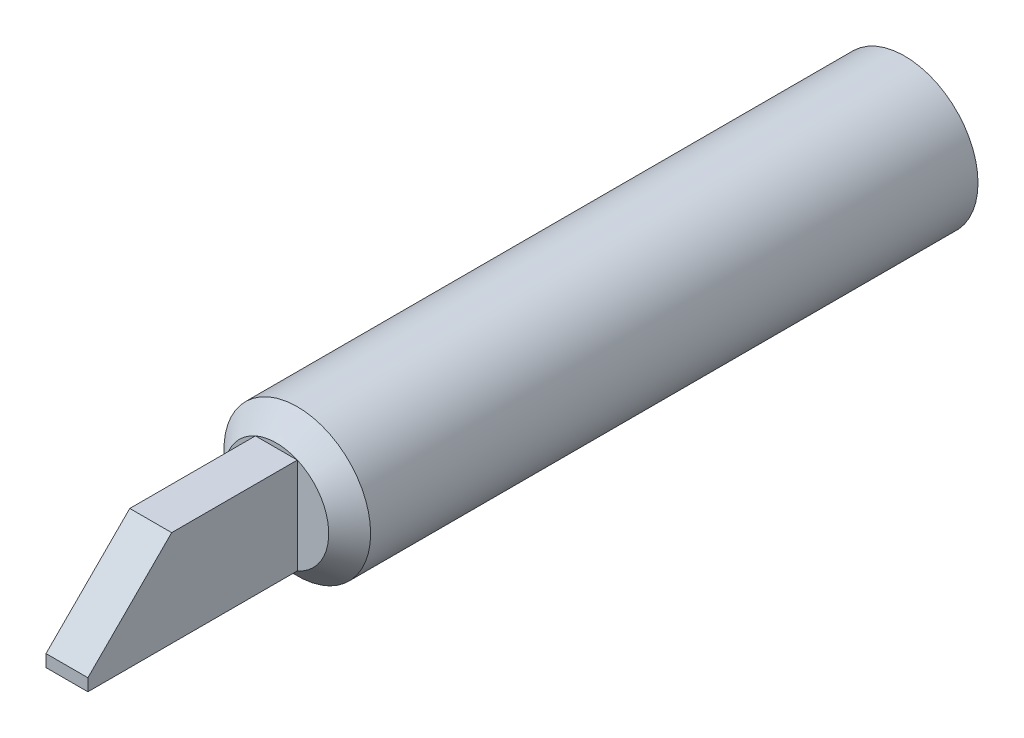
from build123d import *

# Parameters (mm, degrees)
SKETCH1_R           = 3.5
BASE_EXTRUDE_DEPTH  = 30
CHAMFER2_SIZE       = 1
SKETCH2_W           = 2
SKETCH2_H           = 4.582575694
BOSS_EXTRUDE1_DEPTH = 10
CHAMFER5_SIZE       = 4


with BuildPart() as part:
    # Sketch1 → Base-Extrude (new body)
    with BuildSketch(Plane.XY):
        Circle(SKETCH1_R)
    extrude(amount=BASE_EXTRUDE_DEPTH)

    # Chamfer2
    chamfer2_edges = [part.edges().sort_by_distance(p)[0] for p in [
        (-3.5, 0, 30),
    ]]
    chamfer(chamfer2_edges, length=CHAMFER2_SIZE)

    # Sketch2 → Boss-Extrude1 (add)
    with BuildSketch(Plane.XY.offset(30)):
        Rectangle(SKETCH2_W, SKETCH2_H)
    extrude(amount=BOSS_EXTRUDE1_DEPTH)

    # Chamfer5
    chamfer5_edges = [part.edges().sort_by_distance(p)[0] for p in [
        (0, 2.291287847, 40),
    ]]
    chamfer(chamfer5_edges, length=CHAMFER5_SIZE)


solid = part.part
